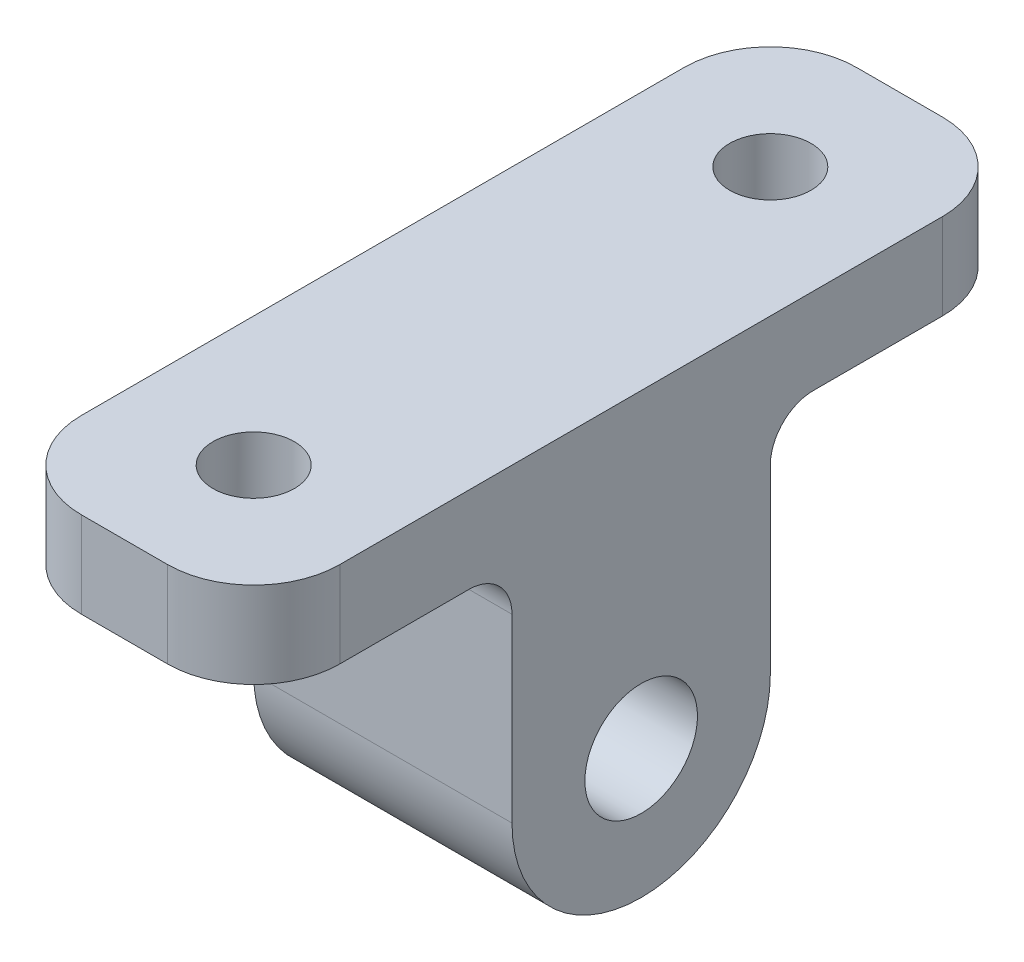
from build123d import *

# Parameters (mm, degrees)
SKETCH2_R             = 2.075
BOSS_EXTRUDE1_DEPTH   = 9.525
F_3_0MM_DOWEL_HOLE1_D = 3
FILLET1_R             = 3.175
FILLET2_R             = 1.5875


with BuildPart() as part:
    # Sketch2 → Boss-Extrude1 (new body)
    with BuildSketch(Plane(origin=(0, 0, 0), x_dir=(0, 0, -1), z_dir=(1, 0, 0))):
        with BuildLine():
            Line((-4.7625, 0), (-4.7625, 8.255))
            Line((-4.7625, 8.255), (-14.2875, 8.255))
            Line((-14.2875, 8.255), (-14.2875, 11.43))
            Line((-14.2875, 11.43), (14.2875, 11.43))
            Line((14.2875, 11.43), (14.2875, 8.255))
            Line((14.2875, 8.255), (4.7625, 8.255))
            Line((4.7625, 8.255), (4.7625, 0))
            ThreePointArc((4.7625, 0), (0, -4.7625), (-4.7625, 0))
        make_face()
        with Locations(Location((0, 0, 0), (0, 0, 180))):
            Circle(SKETCH2_R, mode=Mode.SUBTRACT)
    extrude(amount=BOSS_EXTRUDE1_DEPTH)

    # 3.0mm Dowel Hole1 (through all)
    with Locations(Plane(origin=(0, 11.43, 0), x_dir=(1, 0, 0), z_dir=(0, 1, 0))):
        with Locations((4.7625, 9.525), (4.7625, -9.525)):
            Hole(F_3_0MM_DOWEL_HOLE1_D / 2)

    # Fillet1
    fillet1_edges = [part.edges().sort_by_distance(p)[0] for p in [
        (0, 9.8425, 14.2875),
        (0, 9.8425, -14.2875),
        (9.525, 9.8425, -14.2875),
        (9.525, 9.8425, 14.2875),
    ]]
    fillet(fillet1_edges, radius=FILLET1_R)

    # Fillet2
    fillet2_edges = [part.edges().sort_by_distance(p)[0] for p in [
        (4.7625, 8.255, 4.7625),
        (4.7625, 8.255, -4.7625),
    ]]
    fillet(fillet2_edges, radius=FILLET2_R)


solid = part.part
